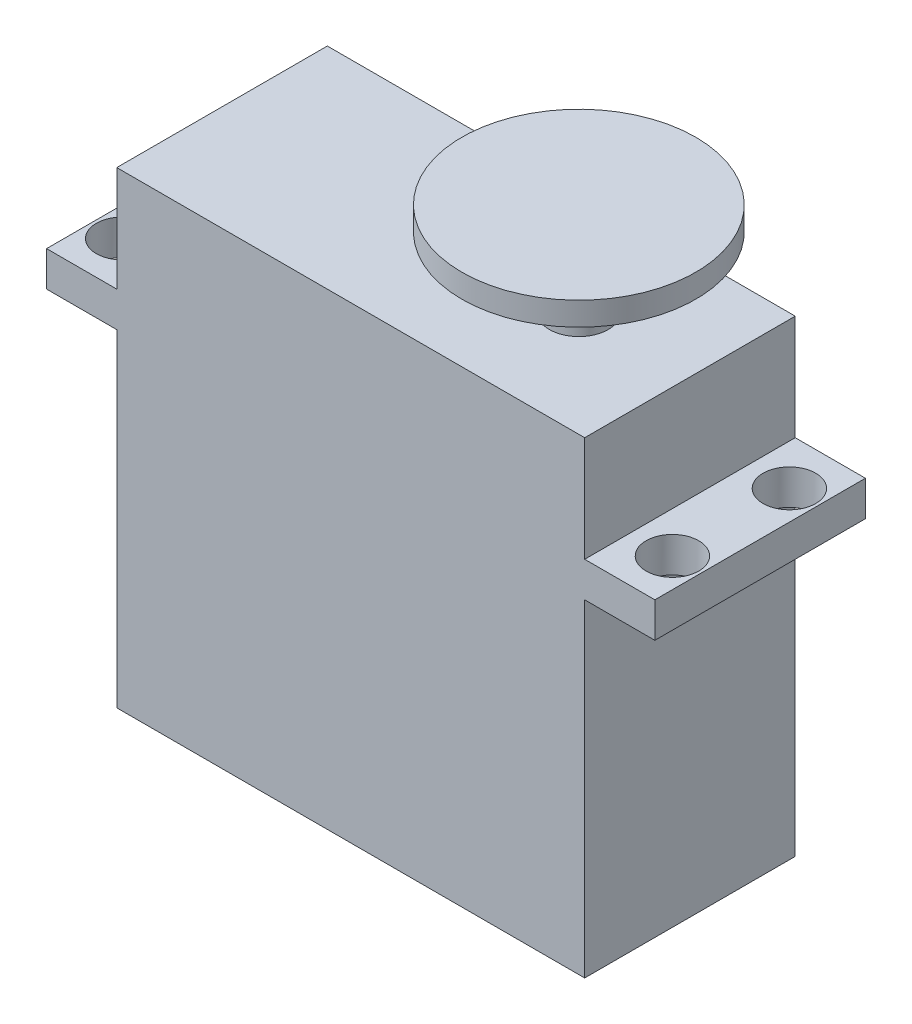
ISO-10303-21;
HEADER;
FILE_DESCRIPTION(('STEP AP214'),'2;1');
FILE_NAME('part.step','',(''),(''),'','','');
FILE_SCHEMA(('AUTOMOTIVE_DESIGN { 1 0 10303 214 1 1 1 1 }'));
ENDSEC;
DATA;
#1=APPLICATION_CONTEXT('core data for automotive mechanical design processes');
#2=APPLICATION_PROTOCOL_DEFINITION('international standard','automotive_design',2000,#1);
#3=PRODUCT_CONTEXT('',#1,'mechanical');
#4=PRODUCT('Part','Part','',(#3));
#5=PRODUCT_RELATED_PRODUCT_CATEGORY('part','',(#4));
#6=PRODUCT_DEFINITION_FORMATION('','',#4);
#7=PRODUCT_DEFINITION_CONTEXT('part definition',#1,'design');
#8=PRODUCT_DEFINITION('design','',#6,#7);
#9=PRODUCT_DEFINITION_SHAPE('','',#8);
#10=(LENGTH_UNIT() NAMED_UNIT(*) SI_UNIT(.MILLI.,.METRE.));
#11=(NAMED_UNIT(*) PLANE_ANGLE_UNIT() SI_UNIT($,.RADIAN.));
#12=(NAMED_UNIT(*) SI_UNIT($,.STERADIAN.) SOLID_ANGLE_UNIT());
#13=UNCERTAINTY_MEASURE_WITH_UNIT(LENGTH_MEASURE(1.E-05),#10,'distance_accuracy_value','');
#14=(GEOMETRIC_REPRESENTATION_CONTEXT(3) GLOBAL_UNCERTAINTY_ASSIGNED_CONTEXT((#13)) GLOBAL_UNIT_ASSIGNED_CONTEXT((#10,
#11,#12)) REPRESENTATION_CONTEXT('',''));
#15=CARTESIAN_POINT('',(0.,0.,0.));
#16=DIRECTION('',(0.,0.,1.));
#17=DIRECTION('',(1.,0.,0.));
#18=AXIS2_PLACEMENT_3D('',#15,#16,#17);
#19=CARTESIAN_POINT('',(40.,40.,0.));
#20=DIRECTION('',(-1.,0.,0.));
#21=DIRECTION('',(0.,0.,1.));
#22=AXIS2_PLACEMENT_3D('',#19,#20,#21);
#23=PLANE('',#22);
#24=DIRECTION('',(0.,0.,-1.));
#25=VECTOR('',#24,1.);
#26=CARTESIAN_POINT('',(40.,28.,0.));
#27=LINE('',#26,#25);
#28=CARTESIAN_POINT('',(40.,28.,0.));
#29=VERTEX_POINT('',#28);
#30=CARTESIAN_POINT('',(40.,28.,-18.));
#31=VERTEX_POINT('',#30);
#32=EDGE_CURVE('E150',#29,#31,#27,.T.);
#33=ORIENTED_EDGE('',*,*,#32,.F.);
#34=DIRECTION('',(0.,-1.,0.));
#35=VECTOR('',#34,1.);
#36=CARTESIAN_POINT('',(40.,40.,0.));
#37=LINE('',#36,#35);
#38=CARTESIAN_POINT('',(40.,0.,0.));
#39=VERTEX_POINT('',#38);
#40=EDGE_CURVE('E213',#29,#39,#37,.T.);
#41=ORIENTED_EDGE('',*,*,#40,.T.);
#42=DIRECTION('',(0.,0.,-1.));
#43=VECTOR('',#42,1.);
#44=CARTESIAN_POINT('',(40.,0.,0.));
#45=LINE('',#44,#43);
#46=CARTESIAN_POINT('',(40.,0.,-18.));
#47=VERTEX_POINT('',#46);
#48=EDGE_CURVE('E201',#39,#47,#45,.T.);
#49=ORIENTED_EDGE('',*,*,#48,.T.);
#50=DIRECTION('',(0.,-1.,0.));
#51=VECTOR('',#50,1.);
#52=CARTESIAN_POINT('',(40.,40.,-18.));
#53=LINE('',#52,#51);
#54=EDGE_CURVE('E209',#31,#47,#53,.T.);
#55=ORIENTED_EDGE('',*,*,#54,.F.);
#56=EDGE_LOOP('',(#33,#41,#49,#55));
#57=FACE_BOUND('',#56,.T.);
#58=ADVANCED_FACE('F36',(#57),#23,.F.);
#59=CARTESIAN_POINT('',(0.,40.,0.));
#60=DIRECTION('',(1.,0.,0.));
#61=DIRECTION('',(0.,0.,-1.));
#62=AXIS2_PLACEMENT_3D('',#59,#60,#61);
#63=PLANE('',#62);
#64=DIRECTION('',(0.,0.,1.));
#65=VECTOR('',#64,1.);
#66=CARTESIAN_POINT('',(0.,28.,0.));
#67=LINE('',#66,#65);
#68=CARTESIAN_POINT('',(0.,28.,-18.));
#69=VERTEX_POINT('',#68);
#70=CARTESIAN_POINT('',(0.,28.,0.));
#71=VERTEX_POINT('',#70);
#72=EDGE_CURVE('E177',#69,#71,#67,.T.);
#73=ORIENTED_EDGE('',*,*,#72,.F.);
#74=DIRECTION('',(0.,-1.,0.));
#75=VECTOR('',#74,1.);
#76=CARTESIAN_POINT('',(0.,40.,-18.));
#77=LINE('',#76,#75);
#78=CARTESIAN_POINT('',(0.,0.,-18.));
#79=VERTEX_POINT('',#78);
#80=EDGE_CURVE('E196',#69,#79,#77,.T.);
#81=ORIENTED_EDGE('',*,*,#80,.T.);
#82=DIRECTION('',(0.,0.,1.));
#83=VECTOR('',#82,1.);
#84=CARTESIAN_POINT('',(0.,0.,0.));
#85=LINE('',#84,#83);
#86=CARTESIAN_POINT('',(0.,0.,0.));
#87=VERTEX_POINT('',#86);
#88=EDGE_CURVE('E183',#79,#87,#85,.T.);
#89=ORIENTED_EDGE('',*,*,#88,.T.);
#90=DIRECTION('',(0.,-1.,0.));
#91=VECTOR('',#90,1.);
#92=CARTESIAN_POINT('',(0.,40.,0.));
#93=LINE('',#92,#91);
#94=EDGE_CURVE('E215',#71,#87,#93,.T.);
#95=ORIENTED_EDGE('',*,*,#94,.F.);
#96=EDGE_LOOP('',(#73,#81,#89,#95));
#97=FACE_BOUND('',#96,.T.);
#98=ADVANCED_FACE('F228',(#97),#63,.F.);
#99=CARTESIAN_POINT('',(0.,40.,-18.));
#100=VERTEX_POINT('',#99);
#101=CARTESIAN_POINT('',(0.,31.,-18.));
#102=VERTEX_POINT('',#101);
#103=EDGE_CURVE('E206',#100,#102,#77,.T.);
#104=ORIENTED_EDGE('',*,*,#103,.T.);
#105=DIRECTION('',(0.,0.,1.));
#106=VECTOR('',#105,1.);
#107=CARTESIAN_POINT('',(0.,31.,0.));
#108=LINE('',#107,#106);
#109=CARTESIAN_POINT('',(0.,31.,0.));
#110=VERTEX_POINT('',#109);
#111=EDGE_CURVE('E169',#102,#110,#108,.T.);
#112=ORIENTED_EDGE('',*,*,#111,.T.);
#113=CARTESIAN_POINT('',(0.,40.,0.));
#114=VERTEX_POINT('',#113);
#115=EDGE_CURVE('E44',#114,#110,#93,.T.);
#116=ORIENTED_EDGE('',*,*,#115,.F.);
#117=DIRECTION('',(0.,0.,1.));
#118=VECTOR('',#117,1.);
#119=CARTESIAN_POINT('',(0.,40.,0.));
#120=LINE('',#119,#118);
#121=EDGE_CURVE('E186',#100,#114,#120,.T.);
#122=ORIENTED_EDGE('',*,*,#121,.F.);
#123=EDGE_LOOP('',(#104,#112,#116,#122));
#124=FACE_BOUND('',#123,.T.);
#125=ADVANCED_FACE('F38',(#124),#63,.F.);
#126=CARTESIAN_POINT('',(0.,40.,0.));
#127=DIRECTION('',(0.,0.,-1.));
#128=DIRECTION('',(-1.,0.,0.));
#129=AXIS2_PLACEMENT_3D('',#126,#127,#128);
#130=PLANE('',#129);
#131=DIRECTION('',(1.,0.,0.));
#132=VECTOR('',#131,1.);
#133=CARTESIAN_POINT('',(0.,0.,0.));
#134=LINE('',#133,#132);
#135=EDGE_CURVE('E199',#87,#39,#134,.T.);
#136=ORIENTED_EDGE('',*,*,#135,.T.);
#137=ORIENTED_EDGE('',*,*,#40,.F.);
#138=DIRECTION('',(1.,0.,0.));
#139=VECTOR('',#138,1.);
#140=CARTESIAN_POINT('',(0.,28.,0.));
#141=LINE('',#140,#139);
#142=CARTESIAN_POINT('',(46.,28.,0.));
#143=VERTEX_POINT('',#142);
#144=EDGE_CURVE('E140',#29,#143,#141,.T.);
#145=ORIENTED_EDGE('',*,*,#144,.T.);
#146=DIRECTION('',(0.,-1.,0.));
#147=VECTOR('',#146,1.);
#148=CARTESIAN_POINT('',(46.,31.,0.));
#149=LINE('',#148,#147);
#150=CARTESIAN_POINT('',(46.,31.,0.));
#151=VERTEX_POINT('',#150);
#152=EDGE_CURVE('E136',#151,#143,#149,.T.);
#153=ORIENTED_EDGE('',*,*,#152,.F.);
#154=DIRECTION('',(1.,0.,0.));
#155=VECTOR('',#154,1.);
#156=CARTESIAN_POINT('',(0.,31.,0.));
#157=LINE('',#156,#155);
#158=CARTESIAN_POINT('',(40.,31.,0.));
#159=VERTEX_POINT('',#158);
#160=EDGE_CURVE('E124',#159,#151,#157,.T.);
#161=ORIENTED_EDGE('',*,*,#160,.F.);
#162=CARTESIAN_POINT('',(40.,40.,0.));
#163=VERTEX_POINT('',#162);
#164=EDGE_CURVE('E214',#163,#159,#37,.T.);
#165=ORIENTED_EDGE('',*,*,#164,.F.);
#166=DIRECTION('',(1.,0.,0.));
#167=VECTOR('',#166,1.);
#168=CARTESIAN_POINT('',(0.,40.,0.));
#169=LINE('',#168,#167);
#170=EDGE_CURVE('E189',#114,#163,#169,.T.);
#171=ORIENTED_EDGE('',*,*,#170,.F.);
#172=ORIENTED_EDGE('',*,*,#115,.T.);
#173=DIRECTION('',(-1.,0.,0.));
#174=VECTOR('',#173,1.);
#175=CARTESIAN_POINT('',(0.,31.,0.));
#176=LINE('',#175,#174);
#177=CARTESIAN_POINT('',(-6.,31.,0.));
#178=VERTEX_POINT('',#177);
#179=EDGE_CURVE('E59',#110,#178,#176,.T.);
#180=ORIENTED_EDGE('',*,*,#179,.T.);
#181=DIRECTION('',(0.,-1.,0.));
#182=VECTOR('',#181,1.);
#183=CARTESIAN_POINT('',(-6.,31.,0.));
#184=LINE('',#183,#182);
#185=CARTESIAN_POINT('',(-6.,28.,0.));
#186=VERTEX_POINT('',#185);
#187=EDGE_CURVE('E181',#178,#186,#184,.T.);
#188=ORIENTED_EDGE('',*,*,#187,.T.);
#189=DIRECTION('',(-1.,0.,0.));
#190=VECTOR('',#189,1.);
#191=CARTESIAN_POINT('',(0.,28.,0.));
#192=LINE('',#191,#190);
#193=EDGE_CURVE('E167',#71,#186,#192,.T.);
#194=ORIENTED_EDGE('',*,*,#193,.F.);
#195=ORIENTED_EDGE('',*,*,#94,.T.);
#196=EDGE_LOOP('',(#136,#137,#145,#153,#161,#165,#171,#172,#180,#188,#194,#195));
#197=FACE_BOUND('',#196,.T.);
#198=ADVANCED_FACE('F138',(#197),#130,.F.);
#199=ORIENTED_EDGE('',*,*,#164,.T.);
#200=DIRECTION('',(0.,0.,-1.));
#201=VECTOR('',#200,1.);
#202=CARTESIAN_POINT('',(40.,31.,0.));
#203=LINE('',#202,#201);
#204=CARTESIAN_POINT('',(40.,31.,-18.));
#205=VERTEX_POINT('',#204);
#206=EDGE_CURVE('E130',#159,#205,#203,.T.);
#207=ORIENTED_EDGE('',*,*,#206,.T.);
#208=CARTESIAN_POINT('',(40.,40.,-18.));
#209=VERTEX_POINT('',#208);
#210=EDGE_CURVE('E210',#209,#205,#53,.T.);
#211=ORIENTED_EDGE('',*,*,#210,.F.);
#212=DIRECTION('',(0.,0.,-1.));
#213=VECTOR('',#212,1.);
#214=CARTESIAN_POINT('',(40.,40.,0.));
#215=LINE('',#214,#213);
#216=EDGE_CURVE('E192',#163,#209,#215,.T.);
#217=ORIENTED_EDGE('',*,*,#216,.F.);
#218=EDGE_LOOP('',(#199,#207,#211,#217));
#219=FACE_BOUND('',#218,.T.);
#220=ADVANCED_FACE('F256',(#219),#23,.F.);
#221=CARTESIAN_POINT('',(0.,40.,-18.));
#222=DIRECTION('',(0.,0.,1.));
#223=DIRECTION('',(1.,0.,0.));
#224=AXIS2_PLACEMENT_3D('',#221,#222,#223);
#225=PLANE('',#224);
#226=DIRECTION('',(-1.,0.,0.));
#227=VECTOR('',#226,1.);
#228=CARTESIAN_POINT('',(0.,0.,-18.));
#229=LINE('',#228,#227);
#230=EDGE_CURVE('E190',#47,#79,#229,.T.);
#231=ORIENTED_EDGE('',*,*,#230,.T.);
#232=ORIENTED_EDGE('',*,*,#80,.F.);
#233=DIRECTION('',(-1.,0.,0.));
#234=VECTOR('',#233,1.);
#235=CARTESIAN_POINT('',(0.,28.,-18.));
#236=LINE('',#235,#234);
#237=CARTESIAN_POINT('',(-6.,28.,-18.));
#238=VERTEX_POINT('',#237);
#239=EDGE_CURVE('E175',#69,#238,#236,.T.);
#240=ORIENTED_EDGE('',*,*,#239,.T.);
#241=DIRECTION('',(0.,-1.,0.));
#242=VECTOR('',#241,1.);
#243=CARTESIAN_POINT('',(-6.,31.,-18.));
#244=LINE('',#243,#242);
#245=CARTESIAN_POINT('',(-6.,31.,-18.));
#246=VERTEX_POINT('',#245);
#247=EDGE_CURVE('E172',#246,#238,#244,.T.);
#248=ORIENTED_EDGE('',*,*,#247,.F.);
#249=DIRECTION('',(-1.,0.,0.));
#250=VECTOR('',#249,1.);
#251=CARTESIAN_POINT('',(0.,31.,-18.));
#252=LINE('',#251,#250);
#253=EDGE_CURVE('E166',#102,#246,#252,.T.);
#254=ORIENTED_EDGE('',*,*,#253,.F.);
#255=ORIENTED_EDGE('',*,*,#103,.F.);
#256=DIRECTION('',(-1.,0.,0.));
#257=VECTOR('',#256,1.);
#258=CARTESIAN_POINT('',(0.,40.,-18.));
#259=LINE('',#258,#257);
#260=EDGE_CURVE('E194',#209,#100,#259,.T.);
#261=ORIENTED_EDGE('',*,*,#260,.F.);
#262=ORIENTED_EDGE('',*,*,#210,.T.);
#263=DIRECTION('',(1.,0.,0.));
#264=VECTOR('',#263,1.);
#265=CARTESIAN_POINT('',(0.,31.,-18.));
#266=LINE('',#265,#264);
#267=CARTESIAN_POINT('',(46.,31.,-18.));
#268=VERTEX_POINT('',#267);
#269=EDGE_CURVE('E51',#205,#268,#266,.T.);
#270=ORIENTED_EDGE('',*,*,#269,.T.);
#271=DIRECTION('',(0.,-1.,0.));
#272=VECTOR('',#271,1.);
#273=CARTESIAN_POINT('',(46.,31.,-18.));
#274=LINE('',#273,#272);
#275=CARTESIAN_POINT('',(46.,28.,-18.));
#276=VERTEX_POINT('',#275);
#277=EDGE_CURVE('E144',#268,#276,#274,.T.);
#278=ORIENTED_EDGE('',*,*,#277,.T.);
#279=DIRECTION('',(1.,0.,0.));
#280=VECTOR('',#279,1.);
#281=CARTESIAN_POINT('',(0.,28.,-18.));
#282=LINE('',#281,#280);
#283=EDGE_CURVE('E147',#31,#276,#282,.T.);
#284=ORIENTED_EDGE('',*,*,#283,.F.);
#285=ORIENTED_EDGE('',*,*,#54,.T.);
#286=EDGE_LOOP('',(#231,#232,#240,#248,#254,#255,#261,#262,#270,#278,#284,#285));
#287=FACE_BOUND('',#286,.T.);
#288=ADVANCED_FACE('F231',(#287),#225,.F.);
#289=CARTESIAN_POINT('',(0.,40.,0.));
#290=DIRECTION('',(0.,-1.,0.));
#291=DIRECTION('',(0.,0.,-1.));
#292=AXIS2_PLACEMENT_3D('',#289,#290,#291);
#293=PLANE('',#292);
#294=CARTESIAN_POINT('',(30.5,40.,-9.));
#295=DIRECTION('',(0.,-1.,0.));
#296=DIRECTION('',(0.,0.,-1.));
#297=AXIS2_PLACEMENT_3D('',#294,#295,#296);
#298=CIRCLE('',#297,2.5);
#299=CARTESIAN_POINT('',(30.5,40.,-11.5));
#300=VERTEX_POINT('',#299);
#301=EDGE_CURVE('E11',#300,#300,#298,.F.);
#302=ORIENTED_EDGE('',*,*,#301,.F.);
#303=EDGE_LOOP('',(#302));
#304=FACE_BOUND('',#303,.T.);
#305=ORIENTED_EDGE('',*,*,#121,.T.);
#306=ORIENTED_EDGE('',*,*,#170,.T.);
#307=ORIENTED_EDGE('',*,*,#216,.T.);
#308=ORIENTED_EDGE('',*,*,#260,.T.);
#309=EDGE_LOOP('',(#305,#306,#307,#308));
#310=FACE_BOUND('',#309,.T.);
#311=ADVANCED_FACE('F267',(#304,#310),#293,.F.);
#312=CARTESIAN_POINT('',(0.,0.,0.));
#313=DIRECTION('',(0.,-1.,0.));
#314=DIRECTION('',(0.,0.,-1.));
#315=AXIS2_PLACEMENT_3D('',#312,#313,#314);
#316=PLANE('',#315);
#317=ORIENTED_EDGE('',*,*,#88,.F.);
#318=ORIENTED_EDGE('',*,*,#230,.F.);
#319=ORIENTED_EDGE('',*,*,#48,.F.);
#320=ORIENTED_EDGE('',*,*,#135,.F.);
#321=EDGE_LOOP('',(#317,#318,#319,#320));
#322=FACE_BOUND('',#321,.T.);
#323=ADVANCED_FACE('F226',(#322),#316,.T.);
#324=CARTESIAN_POINT('',(-6.,31.,0.));
#325=DIRECTION('',(1.,0.,0.));
#326=DIRECTION('',(0.,0.,-1.));
#327=AXIS2_PLACEMENT_3D('',#324,#325,#326);
#328=PLANE('',#327);
#329=DIRECTION('',(0.,0.,1.));
#330=VECTOR('',#329,1.);
#331=CARTESIAN_POINT('',(-6.,28.,0.));
#332=LINE('',#331,#330);
#333=EDGE_CURVE('E162',#238,#186,#332,.T.);
#334=ORIENTED_EDGE('',*,*,#333,.T.);
#335=ORIENTED_EDGE('',*,*,#187,.F.);
#336=DIRECTION('',(0.,0.,1.));
#337=VECTOR('',#336,1.);
#338=CARTESIAN_POINT('',(-6.,31.,0.));
#339=LINE('',#338,#337);
#340=EDGE_CURVE('E164',#246,#178,#339,.T.);
#341=ORIENTED_EDGE('',*,*,#340,.F.);
#342=ORIENTED_EDGE('',*,*,#247,.T.);
#343=EDGE_LOOP('',(#334,#335,#341,#342));
#344=FACE_BOUND('',#343,.T.);
#345=ADVANCED_FACE('F281',(#344),#328,.F.);
#346=CARTESIAN_POINT('',(0.,31.,0.));
#347=DIRECTION('',(0.,-1.,0.));
#348=DIRECTION('',(0.,0.,-1.));
#349=AXIS2_PLACEMENT_3D('',#346,#347,#348);
#350=PLANE('',#349);
#351=CARTESIAN_POINT('',(-3.5,31.,-14.));
#352=DIRECTION('',(0.,1.,0.));
#353=DIRECTION('',(0.,0.,1.));
#354=AXIS2_PLACEMENT_3D('',#351,#352,#353);
#355=CIRCLE('',#354,2.25);
#356=CARTESIAN_POINT('',(-3.5,31.,-11.75));
#357=VERTEX_POINT('',#356);
#358=EDGE_CURVE('E403',#357,#357,#355,.T.);
#359=ORIENTED_EDGE('',*,*,#358,.F.);
#360=EDGE_LOOP('',(#359));
#361=FACE_BOUND('',#360,.T.);
#362=CARTESIAN_POINT('',(-3.5,31.,-4.));
#363=DIRECTION('',(0.,1.,0.));
#364=DIRECTION('',(0.,0.,1.));
#365=AXIS2_PLACEMENT_3D('',#362,#363,#364);
#366=CIRCLE('',#365,2.25);
#367=CARTESIAN_POINT('',(-3.5,31.,-1.75));
#368=VERTEX_POINT('',#367);
#369=EDGE_CURVE('E412',#368,#368,#366,.T.);
#370=ORIENTED_EDGE('',*,*,#369,.F.);
#371=EDGE_LOOP('',(#370));
#372=FACE_BOUND('',#371,.T.);
#373=ORIENTED_EDGE('',*,*,#340,.T.);
#374=ORIENTED_EDGE('',*,*,#179,.F.);
#375=ORIENTED_EDGE('',*,*,#111,.F.);
#376=ORIENTED_EDGE('',*,*,#253,.T.);
#377=EDGE_LOOP('',(#373,#374,#375,#376));
#378=FACE_BOUND('',#377,.T.);
#379=ADVANCED_FACE('F275',(#361,#372,#378),#350,.F.);
#380=CARTESIAN_POINT('',(0.,28.,0.));
#381=DIRECTION('',(0.,-1.,0.));
#382=DIRECTION('',(0.,0.,-1.));
#383=AXIS2_PLACEMENT_3D('',#380,#381,#382);
#384=PLANE('',#383);
#385=CARTESIAN_POINT('',(-3.5,28.,-14.));
#386=DIRECTION('',(0.,-1.,0.));
#387=DIRECTION('',(0.,0.,-1.));
#388=AXIS2_PLACEMENT_3D('',#385,#386,#387);
#389=CIRCLE('',#388,2.25);
#390=CARTESIAN_POINT('',(-3.5,28.,-16.25));
#391=VERTEX_POINT('',#390);
#392=EDGE_CURVE('E406',#391,#391,#389,.F.);
#393=ORIENTED_EDGE('',*,*,#392,.T.);
#394=EDGE_LOOP('',(#393));
#395=FACE_BOUND('',#394,.T.);
#396=CARTESIAN_POINT('',(-3.5,28.,-4.));
#397=DIRECTION('',(0.,-1.,0.));
#398=DIRECTION('',(0.,0.,-1.));
#399=AXIS2_PLACEMENT_3D('',#396,#397,#398);
#400=CIRCLE('',#399,2.25);
#401=CARTESIAN_POINT('',(-3.5,28.,-6.25));
#402=VERTEX_POINT('',#401);
#403=EDGE_CURVE('E409',#402,#402,#400,.F.);
#404=ORIENTED_EDGE('',*,*,#403,.T.);
#405=EDGE_LOOP('',(#404));
#406=FACE_BOUND('',#405,.T.);
#407=ORIENTED_EDGE('',*,*,#333,.F.);
#408=ORIENTED_EDGE('',*,*,#239,.F.);
#409=ORIENTED_EDGE('',*,*,#72,.T.);
#410=ORIENTED_EDGE('',*,*,#193,.T.);
#411=EDGE_LOOP('',(#407,#408,#409,#410));
#412=FACE_BOUND('',#411,.T.);
#413=ADVANCED_FACE('F283',(#395,#406,#412),#384,.T.);
#414=CARTESIAN_POINT('',(46.,31.,0.));
#415=DIRECTION('',(-1.,0.,0.));
#416=DIRECTION('',(0.,0.,1.));
#417=AXIS2_PLACEMENT_3D('',#414,#415,#416);
#418=PLANE('',#417);
#419=DIRECTION('',(0.,0.,-1.));
#420=VECTOR('',#419,1.);
#421=CARTESIAN_POINT('',(46.,28.,0.));
#422=LINE('',#421,#420);
#423=EDGE_CURVE('E158',#143,#276,#422,.T.);
#424=ORIENTED_EDGE('',*,*,#423,.T.);
#425=ORIENTED_EDGE('',*,*,#277,.F.);
#426=DIRECTION('',(0.,0.,-1.));
#427=VECTOR('',#426,1.);
#428=CARTESIAN_POINT('',(46.,31.,0.));
#429=LINE('',#428,#427);
#430=EDGE_CURVE('E128',#151,#268,#429,.T.);
#431=ORIENTED_EDGE('',*,*,#430,.F.);
#432=ORIENTED_EDGE('',*,*,#152,.T.);
#433=EDGE_LOOP('',(#424,#425,#431,#432));
#434=FACE_BOUND('',#433,.T.);
#435=ADVANCED_FACE('F146',(#434),#418,.F.);
#436=CARTESIAN_POINT('',(0.,31.,0.));
#437=DIRECTION('',(0.,-1.,0.));
#438=DIRECTION('',(0.,0.,-1.));
#439=AXIS2_PLACEMENT_3D('',#436,#437,#438);
#440=PLANE('',#439);
#441=CARTESIAN_POINT('',(43.5,31.,-14.));
#442=DIRECTION('',(0.,-1.,0.));
#443=DIRECTION('',(0.,0.,1.));
#444=AXIS2_PLACEMENT_3D('',#441,#442,#443);
#445=CIRCLE('',#444,2.25);
#446=CARTESIAN_POINT('',(43.5,31.,-11.75));
#447=VERTEX_POINT('',#446);
#448=EDGE_CURVE('E420',#447,#447,#445,.T.);
#449=ORIENTED_EDGE('',*,*,#448,.T.);
#450=EDGE_LOOP('',(#449));
#451=FACE_BOUND('',#450,.T.);
#452=CARTESIAN_POINT('',(43.5,31.,-4.));
#453=DIRECTION('',(0.,-1.,0.));
#454=DIRECTION('',(0.,0.,1.));
#455=AXIS2_PLACEMENT_3D('',#452,#453,#454);
#456=CIRCLE('',#455,2.25);
#457=CARTESIAN_POINT('',(43.5,31.,-1.75));
#458=VERTEX_POINT('',#457);
#459=EDGE_CURVE('E421',#458,#458,#456,.T.);
#460=ORIENTED_EDGE('',*,*,#459,.T.);
#461=EDGE_LOOP('',(#460));
#462=FACE_BOUND('',#461,.T.);
#463=ORIENTED_EDGE('',*,*,#430,.T.);
#464=ORIENTED_EDGE('',*,*,#269,.F.);
#465=ORIENTED_EDGE('',*,*,#206,.F.);
#466=ORIENTED_EDGE('',*,*,#160,.T.);
#467=EDGE_LOOP('',(#463,#464,#465,#466));
#468=FACE_BOUND('',#467,.T.);
#469=ADVANCED_FACE('F126',(#451,#462,#468),#440,.F.);
#470=CARTESIAN_POINT('',(0.,28.,0.));
#471=DIRECTION('',(0.,-1.,0.));
#472=DIRECTION('',(0.,0.,-1.));
#473=AXIS2_PLACEMENT_3D('',#470,#471,#472);
#474=PLANE('',#473);
#475=CARTESIAN_POINT('',(43.5,28.,-14.));
#476=DIRECTION('',(0.,-1.,0.));
#477=DIRECTION('',(0.,0.,-1.));
#478=AXIS2_PLACEMENT_3D('',#475,#476,#477);
#479=CIRCLE('',#478,2.25);
#480=CARTESIAN_POINT('',(43.5,28.,-16.25));
#481=VERTEX_POINT('',#480);
#482=EDGE_CURVE('E413',#481,#481,#479,.T.);
#483=ORIENTED_EDGE('',*,*,#482,.F.);
#484=EDGE_LOOP('',(#483));
#485=FACE_BOUND('',#484,.T.);
#486=CARTESIAN_POINT('',(43.5,28.,-4.));
#487=DIRECTION('',(0.,-1.,0.));
#488=DIRECTION('',(0.,0.,-1.));
#489=AXIS2_PLACEMENT_3D('',#486,#487,#488);
#490=CIRCLE('',#489,2.25);
#491=CARTESIAN_POINT('',(43.5,28.,-6.25));
#492=VERTEX_POINT('',#491);
#493=EDGE_CURVE('E417',#492,#492,#490,.T.);
#494=ORIENTED_EDGE('',*,*,#493,.F.);
#495=EDGE_LOOP('',(#494));
#496=FACE_BOUND('',#495,.T.);
#497=ORIENTED_EDGE('',*,*,#423,.F.);
#498=ORIENTED_EDGE('',*,*,#144,.F.);
#499=ORIENTED_EDGE('',*,*,#32,.T.);
#500=ORIENTED_EDGE('',*,*,#283,.T.);
#501=EDGE_LOOP('',(#497,#498,#499,#500));
#502=FACE_BOUND('',#501,.T.);
#503=ADVANCED_FACE('F237',(#485,#496,#502),#474,.T.);
#504=CARTESIAN_POINT('',(30.5,46.,-9.));
#505=DIRECTION('',(0.,-1.,0.));
#506=DIRECTION('',(0.,0.,-1.));
#507=AXIS2_PLACEMENT_3D('',#504,#505,#506);
#508=CYLINDRICAL_SURFACE('',#507,2.5);
#509=CARTESIAN_POINT('',(30.5,46.,-9.));
#510=DIRECTION('',(0.,1.,0.));
#511=DIRECTION('',(0.,0.,1.));
#512=AXIS2_PLACEMENT_3D('',#509,#510,#511);
#513=CIRCLE('',#512,2.5);
#514=CARTESIAN_POINT('',(30.5,46.,-6.5));
#515=VERTEX_POINT('',#514);
#516=EDGE_CURVE('E153',#515,#515,#513,.T.);
#517=ORIENTED_EDGE('',*,*,#516,.F.);
#518=EDGE_LOOP('',(#517));
#519=FACE_BOUND('',#518,.T.);
#520=ORIENTED_EDGE('',*,*,#301,.T.);
#521=EDGE_LOOP('',(#520));
#522=FACE_BOUND('',#521,.T.);
#523=ADVANCED_FACE('F239',(#519,#522),#508,.T.);
#524=CARTESIAN_POINT('',(30.5,48.,-9.));
#525=DIRECTION('',(0.,-1.,0.));
#526=DIRECTION('',(0.,0.,-1.));
#527=AXIS2_PLACEMENT_3D('',#524,#525,#526);
#528=CYLINDRICAL_SURFACE('',#527,10.);
#529=CARTESIAN_POINT('',(30.5,48.,-9.));
#530=DIRECTION('',(0.,1.,0.));
#531=DIRECTION('',(0.,0.,1.));
#532=AXIS2_PLACEMENT_3D('',#529,#530,#531);
#533=CIRCLE('',#532,10.);
#534=CARTESIAN_POINT('',(30.5,48.,1.));
#535=VERTEX_POINT('',#534);
#536=EDGE_CURVE('E398',#535,#535,#533,.T.);
#537=ORIENTED_EDGE('',*,*,#536,.F.);
#538=EDGE_LOOP('',(#537));
#539=FACE_BOUND('',#538,.T.);
#540=CARTESIAN_POINT('',(30.5,46.,-9.));
#541=DIRECTION('',(0.,1.,0.));
#542=DIRECTION('',(0.,0.,1.));
#543=AXIS2_PLACEMENT_3D('',#540,#541,#542);
#544=CIRCLE('',#543,10.);
#545=CARTESIAN_POINT('',(30.5,46.,1.));
#546=VERTEX_POINT('',#545);
#547=EDGE_CURVE('E401',#546,#546,#544,.T.);
#548=ORIENTED_EDGE('',*,*,#547,.T.);
#549=EDGE_LOOP('',(#548));
#550=FACE_BOUND('',#549,.T.);
#551=ADVANCED_FACE('F246',(#539,#550),#528,.T.);
#552=CARTESIAN_POINT('',(30.5,48.,-9.));
#553=DIRECTION('',(0.,1.,0.));
#554=DIRECTION('',(0.,0.,1.));
#555=AXIS2_PLACEMENT_3D('',#552,#553,#554);
#556=PLANE('',#555);
#557=ORIENTED_EDGE('',*,*,#536,.T.);
#558=EDGE_LOOP('',(#557));
#559=FACE_BOUND('',#558,.T.);
#560=ADVANCED_FACE('F385',(#559),#556,.T.);
#561=CARTESIAN_POINT('',(30.5,46.,-9.));
#562=DIRECTION('',(0.,1.,0.));
#563=DIRECTION('',(0.,0.,1.));
#564=AXIS2_PLACEMENT_3D('',#561,#562,#563);
#565=PLANE('',#564);
#566=ORIENTED_EDGE('',*,*,#516,.T.);
#567=EDGE_LOOP('',(#566));
#568=FACE_BOUND('',#567,.T.);
#569=ORIENTED_EDGE('',*,*,#547,.F.);
#570=EDGE_LOOP('',(#569));
#571=FACE_BOUND('',#570,.T.);
#572=ADVANCED_FACE('F322',(#568,#571),#565,.F.);
#573=CARTESIAN_POINT('',(-3.5,-0.001000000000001,-4.));
#574=DIRECTION('',(0.,1.,0.));
#575=DIRECTION('',(0.,0.,1.));
#576=AXIS2_PLACEMENT_3D('',#573,#574,#575);
#577=CYLINDRICAL_SURFACE('',#576,2.25);
#578=ORIENTED_EDGE('',*,*,#403,.F.);
#579=EDGE_LOOP('',(#578));
#580=FACE_BOUND('',#579,.T.);
#581=ORIENTED_EDGE('',*,*,#369,.T.);
#582=EDGE_LOOP('',(#581));
#583=FACE_BOUND('',#582,.T.);
#584=ADVANCED_FACE('F332',(#580,#583),#577,.F.);
#585=CARTESIAN_POINT('',(-3.5,-0.001000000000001,-14.));
#586=DIRECTION('',(0.,1.,0.));
#587=DIRECTION('',(0.,0.,1.));
#588=AXIS2_PLACEMENT_3D('',#585,#586,#587);
#589=CYLINDRICAL_SURFACE('',#588,2.25);
#590=ORIENTED_EDGE('',*,*,#392,.F.);
#591=EDGE_LOOP('',(#590));
#592=FACE_BOUND('',#591,.T.);
#593=ORIENTED_EDGE('',*,*,#358,.T.);
#594=EDGE_LOOP('',(#593));
#595=FACE_BOUND('',#594,.T.);
#596=ADVANCED_FACE('F337',(#592,#595),#589,.F.);
#597=CARTESIAN_POINT('',(43.5,-0.001000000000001,-4.));
#598=DIRECTION('',(0.,1.,0.));
#599=DIRECTION('',(0.,0.,1.));
#600=AXIS2_PLACEMENT_3D('',#597,#598,#599);
#601=CYLINDRICAL_SURFACE('',#600,2.25);
#602=ORIENTED_EDGE('',*,*,#493,.T.);
#603=EDGE_LOOP('',(#602));
#604=FACE_BOUND('',#603,.T.);
#605=ORIENTED_EDGE('',*,*,#459,.F.);
#606=EDGE_LOOP('',(#605));
#607=FACE_BOUND('',#606,.T.);
#608=ADVANCED_FACE('F347',(#604,#607),#601,.F.);
#609=CARTESIAN_POINT('',(43.5,-0.001000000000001,-14.));
#610=DIRECTION('',(0.,1.,0.));
#611=DIRECTION('',(0.,0.,1.));
#612=AXIS2_PLACEMENT_3D('',#609,#610,#611);
#613=CYLINDRICAL_SURFACE('',#612,2.25);
#614=ORIENTED_EDGE('',*,*,#482,.T.);
#615=EDGE_LOOP('',(#614));
#616=FACE_BOUND('',#615,.T.);
#617=ORIENTED_EDGE('',*,*,#448,.F.);
#618=EDGE_LOOP('',(#617));
#619=FACE_BOUND('',#618,.T.);
#620=ADVANCED_FACE('F368',(#616,#619),#613,.F.);
#621=CLOSED_SHELL('',(#58,#98,#125,#198,#220,#288,#311,#323,#345,#379,#413,#435,#469,#503,#523,
#551,#560,#572,#584,#596,#608,#620));
#622=MANIFOLD_SOLID_BREP('B2',#621);
#623=ADVANCED_BREP_SHAPE_REPRESENTATION('',(#18,#622),#14);
#624=SHAPE_DEFINITION_REPRESENTATION(#9,#623);
ENDSEC;
END-ISO-10303-21;
